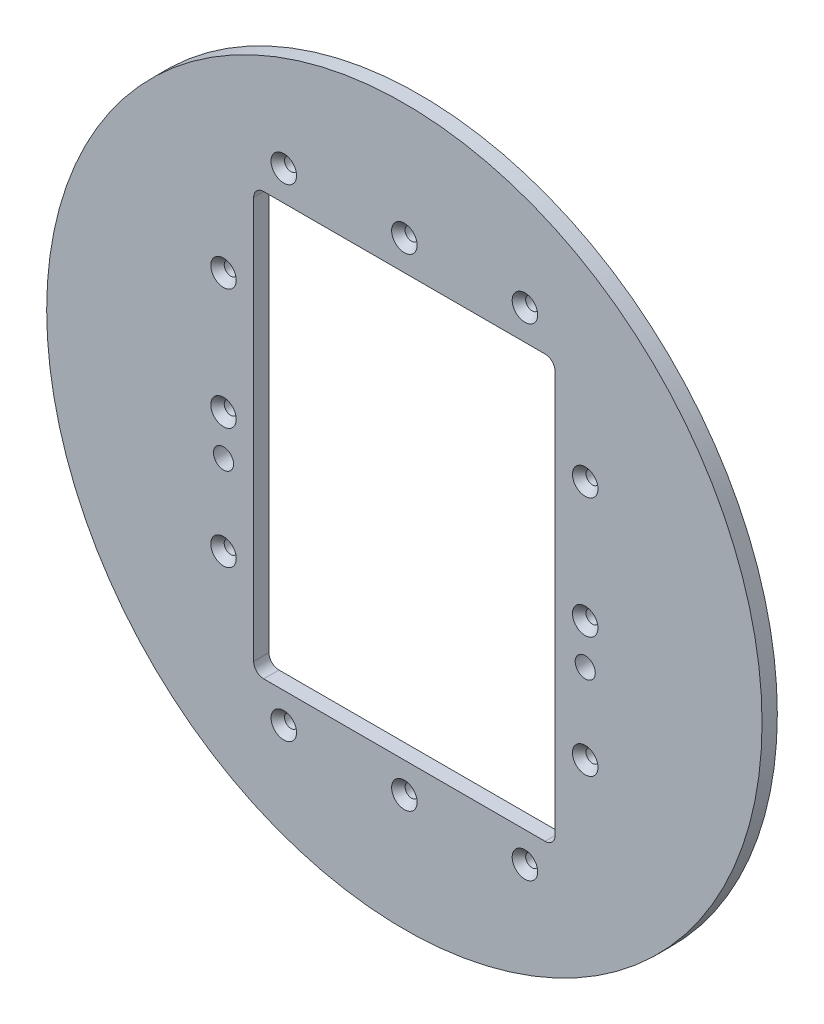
ISO-10303-21;
HEADER;
FILE_DESCRIPTION(('STEP AP214'),'2;1');
FILE_NAME('part.step','',(''),(''),'','','');
FILE_SCHEMA(('AUTOMOTIVE_DESIGN { 1 0 10303 214 1 1 1 1 }'));
ENDSEC;
DATA;
#1=APPLICATION_CONTEXT('core data for automotive mechanical design processes');
#2=APPLICATION_PROTOCOL_DEFINITION('international standard','automotive_design',2000,#1);
#3=PRODUCT_CONTEXT('',#1,'mechanical');
#4=PRODUCT('Part','Part','',(#3));
#5=PRODUCT_RELATED_PRODUCT_CATEGORY('part','',(#4));
#6=PRODUCT_DEFINITION_FORMATION('','',#4);
#7=PRODUCT_DEFINITION_CONTEXT('part definition',#1,'design');
#8=PRODUCT_DEFINITION('design','',#6,#7);
#9=PRODUCT_DEFINITION_SHAPE('','',#8);
#10=(LENGTH_UNIT() NAMED_UNIT(*) SI_UNIT(.MILLI.,.METRE.));
#11=(NAMED_UNIT(*) PLANE_ANGLE_UNIT() SI_UNIT($,.RADIAN.));
#12=(NAMED_UNIT(*) SI_UNIT($,.STERADIAN.) SOLID_ANGLE_UNIT());
#13=UNCERTAINTY_MEASURE_WITH_UNIT(LENGTH_MEASURE(1.E-05),#10,'distance_accuracy_value','');
#14=(GEOMETRIC_REPRESENTATION_CONTEXT(3) GLOBAL_UNCERTAINTY_ASSIGNED_CONTEXT((#13)) GLOBAL_UNIT_ASSIGNED_CONTEXT((#10,
#11,#12)) REPRESENTATION_CONTEXT('',''));
#15=CARTESIAN_POINT('',(0.,0.,0.));
#16=DIRECTION('',(0.,0.,1.));
#17=DIRECTION('',(1.,0.,0.));
#18=AXIS2_PLACEMENT_3D('',#15,#16,#17);
#19=CARTESIAN_POINT('',(0.,0.,-9.652));
#20=DIRECTION('',(0.,0.,1.));
#21=DIRECTION('',(1.,0.,0.));
#22=AXIS2_PLACEMENT_3D('',#19,#20,#21);
#23=CYLINDRICAL_SURFACE('',#22,226.06);
#24=CARTESIAN_POINT('',(0.,0.,-9.652));
#25=DIRECTION('',(0.,0.,1.));
#26=DIRECTION('',(1.,0.,0.));
#27=AXIS2_PLACEMENT_3D('',#24,#25,#26);
#28=CIRCLE('',#27,226.06);
#29=CARTESIAN_POINT('',(226.06,0.,-9.652));
#30=VERTEX_POINT('',#29);
#31=EDGE_CURVE('E152',#30,#30,#28,.T.);
#32=ORIENTED_EDGE('',*,*,#31,.T.);
#33=EDGE_LOOP('',(#32));
#34=FACE_BOUND('',#33,.T.);
#35=CARTESIAN_POINT('',(0.,0.,0.));
#36=DIRECTION('',(0.,0.,1.));
#37=DIRECTION('',(1.,0.,0.));
#38=AXIS2_PLACEMENT_3D('',#35,#36,#37);
#39=CIRCLE('',#38,226.06);
#40=CARTESIAN_POINT('',(226.06,0.,0.));
#41=VERTEX_POINT('',#40);
#42=EDGE_CURVE('E156',#41,#41,#39,.T.);
#43=ORIENTED_EDGE('',*,*,#42,.F.);
#44=EDGE_LOOP('',(#43));
#45=FACE_BOUND('',#44,.T.);
#46=ADVANCED_FACE('F41',(#34,#45),#23,.T.);
#47=CARTESIAN_POINT('',(0.,0.,-9.652));
#48=DIRECTION('',(0.,0.,1.));
#49=DIRECTION('',(1.,0.,0.));
#50=AXIS2_PLACEMENT_3D('',#47,#48,#49);
#51=PLANE('',#50);
#52=CARTESIAN_POINT('',(-114.3,-25.4,-9.652));
#53=DIRECTION('',(0.,0.,1.));
#54=DIRECTION('',(1.,0.,0.));
#55=AXIS2_PLACEMENT_3D('',#52,#53,#54);
#56=CIRCLE('',#55,6.34999999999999);
#57=CARTESIAN_POINT('',(-107.95,-25.4,-9.652));
#58=VERTEX_POINT('',#57);
#59=EDGE_CURVE('E365',#58,#58,#56,.T.);
#60=ORIENTED_EDGE('',*,*,#59,.T.);
#61=EDGE_LOOP('',(#60));
#62=FACE_BOUND('',#61,.T.);
#63=CARTESIAN_POINT('',(114.3,-25.4,-9.652));
#64=DIRECTION('',(0.,0.,1.));
#65=DIRECTION('',(1.,0.,0.));
#66=AXIS2_PLACEMENT_3D('',#63,#64,#65);
#67=CIRCLE('',#66,6.34999999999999);
#68=CARTESIAN_POINT('',(120.65,-25.4,-9.652));
#69=VERTEX_POINT('',#68);
#70=EDGE_CURVE('E357',#69,#69,#67,.T.);
#71=ORIENTED_EDGE('',*,*,#70,.T.);
#72=EDGE_LOOP('',(#71));
#73=FACE_BOUND('',#72,.T.);
#74=CARTESIAN_POINT('',(0.,152.4,-9.652));
#75=DIRECTION('',(0.,0.,1.));
#76=DIRECTION('',(1.,0.,0.));
#77=AXIS2_PLACEMENT_3D('',#74,#75,#76);
#78=CIRCLE('',#77,4.1021);
#79=CARTESIAN_POINT('',(4.1021,152.4,-9.652));
#80=VERTEX_POINT('',#79);
#81=EDGE_CURVE('E345',#80,#80,#78,.T.);
#82=ORIENTED_EDGE('',*,*,#81,.T.);
#83=EDGE_LOOP('',(#82));
#84=FACE_BOUND('',#83,.T.);
#85=CARTESIAN_POINT('',(0.,-152.4,-9.652));
#86=DIRECTION('',(0.,0.,1.));
#87=DIRECTION('',(1.,0.,0.));
#88=AXIS2_PLACEMENT_3D('',#85,#86,#87);
#89=CIRCLE('',#88,4.1021);
#90=CARTESIAN_POINT('',(4.1021,-152.4,-9.652));
#91=VERTEX_POINT('',#90);
#92=EDGE_CURVE('E333',#91,#91,#89,.T.);
#93=ORIENTED_EDGE('',*,*,#92,.T.);
#94=EDGE_LOOP('',(#93));
#95=FACE_BOUND('',#94,.T.);
#96=CARTESIAN_POINT('',(114.3,76.2,-9.652));
#97=DIRECTION('',(0.,0.,1.));
#98=DIRECTION('',(1.,0.,0.));
#99=AXIS2_PLACEMENT_3D('',#96,#97,#98);
#100=CIRCLE('',#99,4.1021);
#101=CARTESIAN_POINT('',(118.4021,76.2,-9.652));
#102=VERTEX_POINT('',#101);
#103=EDGE_CURVE('E321',#102,#102,#100,.T.);
#104=ORIENTED_EDGE('',*,*,#103,.T.);
#105=EDGE_LOOP('',(#104));
#106=FACE_BOUND('',#105,.T.);
#107=CARTESIAN_POINT('',(114.3,-76.2,-9.652));
#108=DIRECTION('',(0.,0.,1.));
#109=DIRECTION('',(1.,0.,0.));
#110=AXIS2_PLACEMENT_3D('',#107,#108,#109);
#111=CIRCLE('',#110,4.1021);
#112=CARTESIAN_POINT('',(118.4021,-76.2,-9.652));
#113=VERTEX_POINT('',#112);
#114=EDGE_CURVE('E309',#113,#113,#111,.T.);
#115=ORIENTED_EDGE('',*,*,#114,.T.);
#116=EDGE_LOOP('',(#115));
#117=FACE_BOUND('',#116,.T.);
#118=CARTESIAN_POINT('',(114.3,0.,-9.652));
#119=DIRECTION('',(0.,0.,1.));
#120=DIRECTION('',(1.,0.,0.));
#121=AXIS2_PLACEMENT_3D('',#118,#119,#120);
#122=CIRCLE('',#121,4.1021);
#123=CARTESIAN_POINT('',(118.4021,0.,-9.652));
#124=VERTEX_POINT('',#123);
#125=EDGE_CURVE('E297',#124,#124,#122,.T.);
#126=ORIENTED_EDGE('',*,*,#125,.T.);
#127=EDGE_LOOP('',(#126));
#128=FACE_BOUND('',#127,.T.);
#129=CARTESIAN_POINT('',(-114.3,76.2,-9.652));
#130=DIRECTION('',(0.,0.,1.));
#131=DIRECTION('',(1.,0.,0.));
#132=AXIS2_PLACEMENT_3D('',#129,#130,#131);
#133=CIRCLE('',#132,4.1021);
#134=CARTESIAN_POINT('',(-110.1979,76.2,-9.652));
#135=VERTEX_POINT('',#134);
#136=EDGE_CURVE('E285',#135,#135,#133,.T.);
#137=ORIENTED_EDGE('',*,*,#136,.T.);
#138=EDGE_LOOP('',(#137));
#139=FACE_BOUND('',#138,.T.);
#140=CARTESIAN_POINT('',(-114.3,0.,-9.652));
#141=DIRECTION('',(0.,0.,1.));
#142=DIRECTION('',(1.,0.,0.));
#143=AXIS2_PLACEMENT_3D('',#140,#141,#142);
#144=CIRCLE('',#143,4.1021);
#145=CARTESIAN_POINT('',(-110.1979,0.,-9.652));
#146=VERTEX_POINT('',#145);
#147=EDGE_CURVE('E273',#146,#146,#144,.T.);
#148=ORIENTED_EDGE('',*,*,#147,.T.);
#149=EDGE_LOOP('',(#148));
#150=FACE_BOUND('',#149,.T.);
#151=CARTESIAN_POINT('',(-114.3,-76.2,-9.652));
#152=DIRECTION('',(0.,0.,1.));
#153=DIRECTION('',(1.,0.,0.));
#154=AXIS2_PLACEMENT_3D('',#151,#152,#153);
#155=CIRCLE('',#154,4.1021);
#156=CARTESIAN_POINT('',(-110.1979,-76.2,-9.652));
#157=VERTEX_POINT('',#156);
#158=EDGE_CURVE('E261',#157,#157,#155,.T.);
#159=ORIENTED_EDGE('',*,*,#158,.T.);
#160=EDGE_LOOP('',(#159));
#161=FACE_BOUND('',#160,.T.);
#162=CARTESIAN_POINT('',(-76.2,152.4,-9.652));
#163=DIRECTION('',(0.,0.,1.));
#164=DIRECTION('',(1.,0.,0.));
#165=AXIS2_PLACEMENT_3D('',#162,#163,#164);
#166=CIRCLE('',#165,4.1021);
#167=CARTESIAN_POINT('',(-72.0979,152.4,-9.652));
#168=VERTEX_POINT('',#167);
#169=EDGE_CURVE('E249',#168,#168,#166,.T.);
#170=ORIENTED_EDGE('',*,*,#169,.T.);
#171=EDGE_LOOP('',(#170));
#172=FACE_BOUND('',#171,.T.);
#173=CARTESIAN_POINT('',(76.2,152.4,-9.652));
#174=DIRECTION('',(0.,0.,1.));
#175=DIRECTION('',(1.,0.,0.));
#176=AXIS2_PLACEMENT_3D('',#173,#174,#175);
#177=CIRCLE('',#176,4.1021);
#178=CARTESIAN_POINT('',(80.3021,152.4,-9.652));
#179=VERTEX_POINT('',#178);
#180=EDGE_CURVE('E237',#179,#179,#177,.T.);
#181=ORIENTED_EDGE('',*,*,#180,.T.);
#182=EDGE_LOOP('',(#181));
#183=FACE_BOUND('',#182,.T.);
#184=CARTESIAN_POINT('',(-76.2,-152.4,-9.652));
#185=DIRECTION('',(0.,0.,1.));
#186=DIRECTION('',(1.,0.,0.));
#187=AXIS2_PLACEMENT_3D('',#184,#185,#186);
#188=CIRCLE('',#187,4.1021);
#189=CARTESIAN_POINT('',(-72.0979,-152.4,-9.652));
#190=VERTEX_POINT('',#189);
#191=EDGE_CURVE('E225',#190,#190,#188,.T.);
#192=ORIENTED_EDGE('',*,*,#191,.T.);
#193=EDGE_LOOP('',(#192));
#194=FACE_BOUND('',#193,.T.);
#195=CARTESIAN_POINT('',(76.2000000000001,-152.4,-9.652));
#196=DIRECTION('',(0.,0.,1.));
#197=DIRECTION('',(1.,0.,0.));
#198=AXIS2_PLACEMENT_3D('',#195,#196,#197);
#199=CIRCLE('',#198,4.1021);
#200=CARTESIAN_POINT('',(80.3021000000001,-152.4,-9.652));
#201=VERTEX_POINT('',#200);
#202=EDGE_CURVE('E145',#201,#201,#199,.T.);
#203=ORIENTED_EDGE('',*,*,#202,.T.);
#204=EDGE_LOOP('',(#203));
#205=FACE_BOUND('',#204,.T.);
#206=DIRECTION('',(0.,-1.,0.));
#207=VECTOR('',#206,1.);
#208=CARTESIAN_POINT('',(-95.25,133.35,-9.652));
#209=LINE('',#208,#207);
#210=CARTESIAN_POINT('',(-95.25,127.,-9.652));
#211=VERTEX_POINT('',#210);
#212=CARTESIAN_POINT('',(-95.25,-127.,-9.652));
#213=VERTEX_POINT('',#212);
#214=EDGE_CURVE('E205',#211,#213,#209,.T.);
#215=ORIENTED_EDGE('',*,*,#214,.T.);
#216=CARTESIAN_POINT('',(-88.9,-127.,-9.652));
#217=DIRECTION('',(0.,0.,1.));
#218=DIRECTION('',(1.,0.,0.));
#219=AXIS2_PLACEMENT_3D('',#216,#217,#218);
#220=CIRCLE('',#219,6.35);
#221=CARTESIAN_POINT('',(-88.9,-133.35,-9.652));
#222=VERTEX_POINT('',#221);
#223=EDGE_CURVE('E11',#213,#222,#220,.T.);
#224=ORIENTED_EDGE('',*,*,#223,.T.);
#225=DIRECTION('',(1.,0.,0.));
#226=VECTOR('',#225,1.);
#227=CARTESIAN_POINT('',(95.25,-133.35,-9.652));
#228=LINE('',#227,#226);
#229=CARTESIAN_POINT('',(88.9,-133.35,-9.652));
#230=VERTEX_POINT('',#229);
#231=EDGE_CURVE('E160',#222,#230,#228,.T.);
#232=ORIENTED_EDGE('',*,*,#231,.T.);
#233=CARTESIAN_POINT('',(88.9,-127.,-9.652));
#234=DIRECTION('',(0.,0.,1.));
#235=DIRECTION('',(1.,0.,0.));
#236=AXIS2_PLACEMENT_3D('',#233,#234,#235);
#237=CIRCLE('',#236,6.35);
#238=CARTESIAN_POINT('',(95.25,-127.,-9.652));
#239=VERTEX_POINT('',#238);
#240=EDGE_CURVE('E191',#230,#239,#237,.T.);
#241=ORIENTED_EDGE('',*,*,#240,.T.);
#242=DIRECTION('',(0.,1.,0.));
#243=VECTOR('',#242,1.);
#244=CARTESIAN_POINT('',(95.25,133.35,-9.652));
#245=LINE('',#244,#243);
#246=CARTESIAN_POINT('',(95.25,127.,-9.652));
#247=VERTEX_POINT('',#246);
#248=EDGE_CURVE('E151',#239,#247,#245,.T.);
#249=ORIENTED_EDGE('',*,*,#248,.T.);
#250=CARTESIAN_POINT('',(88.9,127.,-9.652));
#251=DIRECTION('',(0.,0.,1.));
#252=DIRECTION('',(1.,0.,0.));
#253=AXIS2_PLACEMENT_3D('',#250,#251,#252);
#254=CIRCLE('',#253,6.35);
#255=CARTESIAN_POINT('',(88.9,133.35,-9.652));
#256=VERTEX_POINT('',#255);
#257=EDGE_CURVE('E118',#247,#256,#254,.T.);
#258=ORIENTED_EDGE('',*,*,#257,.T.);
#259=DIRECTION('',(-1.,0.,0.));
#260=VECTOR('',#259,1.);
#261=CARTESIAN_POINT('',(95.25,133.35,-9.652));
#262=LINE('',#261,#260);
#263=CARTESIAN_POINT('',(-88.9,133.35,-9.652));
#264=VERTEX_POINT('',#263);
#265=EDGE_CURVE('E127',#256,#264,#262,.T.);
#266=ORIENTED_EDGE('',*,*,#265,.T.);
#267=CARTESIAN_POINT('',(-88.9,127.,-9.652));
#268=DIRECTION('',(0.,0.,1.));
#269=DIRECTION('',(1.,0.,0.));
#270=AXIS2_PLACEMENT_3D('',#267,#268,#269);
#271=CIRCLE('',#270,6.35);
#272=EDGE_CURVE('E185',#264,#211,#271,.T.);
#273=ORIENTED_EDGE('',*,*,#272,.T.);
#274=EDGE_LOOP('',(#215,#224,#232,#241,#249,#258,#266,#273));
#275=FACE_BOUND('',#274,.T.);
#276=ORIENTED_EDGE('',*,*,#31,.F.);
#277=EDGE_LOOP('',(#276));
#278=FACE_BOUND('',#277,.T.);
#279=ADVANCED_FACE('F379',(#62,#73,#84,#95,#106,#117,#128,#139,#150,#161,#172,#183,#194,#205,
#275,#278),#51,.F.);
#280=CARTESIAN_POINT('',(0.,0.,0.));
#281=DIRECTION('',(0.,0.,1.));
#282=DIRECTION('',(1.,0.,0.));
#283=AXIS2_PLACEMENT_3D('',#280,#281,#282);
#284=PLANE('',#283);
#285=CARTESIAN_POINT('',(-114.3,-25.4,0.));
#286=DIRECTION('',(0.,0.,1.));
#287=DIRECTION('',(1.,0.,0.));
#288=AXIS2_PLACEMENT_3D('',#285,#286,#287);
#289=CIRCLE('',#288,6.34999999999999);
#290=CARTESIAN_POINT('',(-107.95,-25.4,0.));
#291=VERTEX_POINT('',#290);
#292=EDGE_CURVE('E369',#291,#291,#289,.T.);
#293=ORIENTED_EDGE('',*,*,#292,.F.);
#294=EDGE_LOOP('',(#293));
#295=FACE_BOUND('',#294,.T.);
#296=CARTESIAN_POINT('',(114.3,-25.4,0.));
#297=DIRECTION('',(0.,0.,1.));
#298=DIRECTION('',(1.,0.,0.));
#299=AXIS2_PLACEMENT_3D('',#296,#297,#298);
#300=CIRCLE('',#299,6.34999999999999);
#301=CARTESIAN_POINT('',(120.65,-25.4,0.));
#302=VERTEX_POINT('',#301);
#303=EDGE_CURVE('E361',#302,#302,#300,.T.);
#304=ORIENTED_EDGE('',*,*,#303,.F.);
#305=EDGE_LOOP('',(#304));
#306=FACE_BOUND('',#305,.T.);
#307=CARTESIAN_POINT('',(0.,152.4,0.));
#308=DIRECTION('',(0.,0.,1.));
#309=DIRECTION('',(1.,0.,0.));
#310=AXIS2_PLACEMENT_3D('',#307,#308,#309);
#311=CIRCLE('',#310,8.064495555);
#312=CARTESIAN_POINT('',(8.064495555,152.4,0.));
#313=VERTEX_POINT('',#312);
#314=EDGE_CURVE('E353',#313,#313,#311,.T.);
#315=ORIENTED_EDGE('',*,*,#314,.F.);
#316=EDGE_LOOP('',(#315));
#317=FACE_BOUND('',#316,.T.);
#318=CARTESIAN_POINT('',(0.,-152.4,0.));
#319=DIRECTION('',(0.,0.,1.));
#320=DIRECTION('',(1.,0.,0.));
#321=AXIS2_PLACEMENT_3D('',#318,#319,#320);
#322=CIRCLE('',#321,8.064495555);
#323=CARTESIAN_POINT('',(8.064495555,-152.4,0.));
#324=VERTEX_POINT('',#323);
#325=EDGE_CURVE('E341',#324,#324,#322,.T.);
#326=ORIENTED_EDGE('',*,*,#325,.F.);
#327=EDGE_LOOP('',(#326));
#328=FACE_BOUND('',#327,.T.);
#329=CARTESIAN_POINT('',(114.3,76.2,0.));
#330=DIRECTION('',(0.,0.,1.));
#331=DIRECTION('',(1.,0.,0.));
#332=AXIS2_PLACEMENT_3D('',#329,#330,#331);
#333=CIRCLE('',#332,8.064495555);
#334=CARTESIAN_POINT('',(122.364495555,76.2,0.));
#335=VERTEX_POINT('',#334);
#336=EDGE_CURVE('E329',#335,#335,#333,.T.);
#337=ORIENTED_EDGE('',*,*,#336,.F.);
#338=EDGE_LOOP('',(#337));
#339=FACE_BOUND('',#338,.T.);
#340=CARTESIAN_POINT('',(114.3,-76.2,0.));
#341=DIRECTION('',(0.,0.,1.));
#342=DIRECTION('',(1.,0.,0.));
#343=AXIS2_PLACEMENT_3D('',#340,#341,#342);
#344=CIRCLE('',#343,8.064495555);
#345=CARTESIAN_POINT('',(122.364495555,-76.2,0.));
#346=VERTEX_POINT('',#345);
#347=EDGE_CURVE('E317',#346,#346,#344,.T.);
#348=ORIENTED_EDGE('',*,*,#347,.F.);
#349=EDGE_LOOP('',(#348));
#350=FACE_BOUND('',#349,.T.);
#351=CARTESIAN_POINT('',(114.3,0.,0.));
#352=DIRECTION('',(0.,0.,1.));
#353=DIRECTION('',(1.,0.,0.));
#354=AXIS2_PLACEMENT_3D('',#351,#352,#353);
#355=CIRCLE('',#354,8.064495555);
#356=CARTESIAN_POINT('',(122.364495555,0.,0.));
#357=VERTEX_POINT('',#356);
#358=EDGE_CURVE('E305',#357,#357,#355,.T.);
#359=ORIENTED_EDGE('',*,*,#358,.F.);
#360=EDGE_LOOP('',(#359));
#361=FACE_BOUND('',#360,.T.);
#362=CARTESIAN_POINT('',(-114.3,76.2,0.));
#363=DIRECTION('',(0.,0.,1.));
#364=DIRECTION('',(1.,0.,0.));
#365=AXIS2_PLACEMENT_3D('',#362,#363,#364);
#366=CIRCLE('',#365,8.064495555);
#367=CARTESIAN_POINT('',(-106.235504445,76.2,0.));
#368=VERTEX_POINT('',#367);
#369=EDGE_CURVE('E293',#368,#368,#366,.T.);
#370=ORIENTED_EDGE('',*,*,#369,.F.);
#371=EDGE_LOOP('',(#370));
#372=FACE_BOUND('',#371,.T.);
#373=CARTESIAN_POINT('',(-114.3,0.,0.));
#374=DIRECTION('',(0.,0.,1.));
#375=DIRECTION('',(1.,0.,0.));
#376=AXIS2_PLACEMENT_3D('',#373,#374,#375);
#377=CIRCLE('',#376,8.064495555);
#378=CARTESIAN_POINT('',(-106.235504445,0.,0.));
#379=VERTEX_POINT('',#378);
#380=EDGE_CURVE('E281',#379,#379,#377,.T.);
#381=ORIENTED_EDGE('',*,*,#380,.F.);
#382=EDGE_LOOP('',(#381));
#383=FACE_BOUND('',#382,.T.);
#384=CARTESIAN_POINT('',(-114.3,-76.2,0.));
#385=DIRECTION('',(0.,0.,1.));
#386=DIRECTION('',(1.,0.,0.));
#387=AXIS2_PLACEMENT_3D('',#384,#385,#386);
#388=CIRCLE('',#387,8.064495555);
#389=CARTESIAN_POINT('',(-106.235504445,-76.2,0.));
#390=VERTEX_POINT('',#389);
#391=EDGE_CURVE('E269',#390,#390,#388,.T.);
#392=ORIENTED_EDGE('',*,*,#391,.F.);
#393=EDGE_LOOP('',(#392));
#394=FACE_BOUND('',#393,.T.);
#395=CARTESIAN_POINT('',(-76.2,152.4,0.));
#396=DIRECTION('',(0.,0.,1.));
#397=DIRECTION('',(1.,0.,0.));
#398=AXIS2_PLACEMENT_3D('',#395,#396,#397);
#399=CIRCLE('',#398,8.064495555);
#400=CARTESIAN_POINT('',(-68.135504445,152.4,0.));
#401=VERTEX_POINT('',#400);
#402=EDGE_CURVE('E257',#401,#401,#399,.T.);
#403=ORIENTED_EDGE('',*,*,#402,.F.);
#404=EDGE_LOOP('',(#403));
#405=FACE_BOUND('',#404,.T.);
#406=CARTESIAN_POINT('',(76.2,152.4,0.));
#407=DIRECTION('',(0.,0.,1.));
#408=DIRECTION('',(1.,0.,0.));
#409=AXIS2_PLACEMENT_3D('',#406,#407,#408);
#410=CIRCLE('',#409,8.064495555);
#411=CARTESIAN_POINT('',(84.264495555,152.4,0.));
#412=VERTEX_POINT('',#411);
#413=EDGE_CURVE('E245',#412,#412,#410,.T.);
#414=ORIENTED_EDGE('',*,*,#413,.F.);
#415=EDGE_LOOP('',(#414));
#416=FACE_BOUND('',#415,.T.);
#417=CARTESIAN_POINT('',(-76.2,-152.4,0.));
#418=DIRECTION('',(0.,0.,1.));
#419=DIRECTION('',(1.,0.,0.));
#420=AXIS2_PLACEMENT_3D('',#417,#418,#419);
#421=CIRCLE('',#420,8.064495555);
#422=CARTESIAN_POINT('',(-68.135504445,-152.4,0.));
#423=VERTEX_POINT('',#422);
#424=EDGE_CURVE('E233',#423,#423,#421,.T.);
#425=ORIENTED_EDGE('',*,*,#424,.F.);
#426=EDGE_LOOP('',(#425));
#427=FACE_BOUND('',#426,.T.);
#428=CARTESIAN_POINT('',(76.2000000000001,-152.4,0.));
#429=DIRECTION('',(0.,0.,1.));
#430=DIRECTION('',(1.,0.,0.));
#431=AXIS2_PLACEMENT_3D('',#428,#429,#430);
#432=CIRCLE('',#431,8.064495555);
#433=CARTESIAN_POINT('',(84.2644955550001,-152.4,0.));
#434=VERTEX_POINT('',#433);
#435=EDGE_CURVE('E221',#434,#434,#432,.T.);
#436=ORIENTED_EDGE('',*,*,#435,.F.);
#437=EDGE_LOOP('',(#436));
#438=FACE_BOUND('',#437,.T.);
#439=DIRECTION('',(0.,1.,0.));
#440=VECTOR('',#439,1.);
#441=CARTESIAN_POINT('',(95.25,133.35,0.));
#442=LINE('',#441,#440);
#443=CARTESIAN_POINT('',(95.25,-127.,0.));
#444=VERTEX_POINT('',#443);
#445=CARTESIAN_POINT('',(95.25,127.,0.));
#446=VERTEX_POINT('',#445);
#447=EDGE_CURVE('E138',#444,#446,#442,.T.);
#448=ORIENTED_EDGE('',*,*,#447,.F.);
#449=CARTESIAN_POINT('',(88.9,-127.,0.));
#450=DIRECTION('',(0.,0.,1.));
#451=DIRECTION('',(1.,0.,0.));
#452=AXIS2_PLACEMENT_3D('',#449,#450,#451);
#453=CIRCLE('',#452,6.35);
#454=CARTESIAN_POINT('',(88.9,-133.35,0.));
#455=VERTEX_POINT('',#454);
#456=EDGE_CURVE('E188',#444,#455,#453,.F.);
#457=ORIENTED_EDGE('',*,*,#456,.T.);
#458=DIRECTION('',(1.,0.,0.));
#459=VECTOR('',#458,1.);
#460=CARTESIAN_POINT('',(95.25,-133.35,0.));
#461=LINE('',#460,#459);
#462=CARTESIAN_POINT('',(-88.9,-133.35,0.));
#463=VERTEX_POINT('',#462);
#464=EDGE_CURVE('E143',#463,#455,#461,.T.);
#465=ORIENTED_EDGE('',*,*,#464,.F.);
#466=CARTESIAN_POINT('',(-88.9,-127.,0.));
#467=DIRECTION('',(0.,0.,1.));
#468=DIRECTION('',(1.,0.,0.));
#469=AXIS2_PLACEMENT_3D('',#466,#467,#468);
#470=CIRCLE('',#469,6.35);
#471=CARTESIAN_POINT('',(-95.25,-127.,0.));
#472=VERTEX_POINT('',#471);
#473=EDGE_CURVE('E50',#463,#472,#470,.F.);
#474=ORIENTED_EDGE('',*,*,#473,.T.);
#475=DIRECTION('',(0.,-1.,0.));
#476=VECTOR('',#475,1.);
#477=CARTESIAN_POINT('',(-95.25,133.35,0.));
#478=LINE('',#477,#476);
#479=CARTESIAN_POINT('',(-95.25,127.,0.));
#480=VERTEX_POINT('',#479);
#481=EDGE_CURVE('E137',#480,#472,#478,.T.);
#482=ORIENTED_EDGE('',*,*,#481,.F.);
#483=CARTESIAN_POINT('',(-88.9,127.,0.));
#484=DIRECTION('',(0.,0.,1.));
#485=DIRECTION('',(1.,0.,0.));
#486=AXIS2_PLACEMENT_3D('',#483,#484,#485);
#487=CIRCLE('',#486,6.35);
#488=CARTESIAN_POINT('',(-88.9,133.35,0.));
#489=VERTEX_POINT('',#488);
#490=EDGE_CURVE('E135',#480,#489,#487,.F.);
#491=ORIENTED_EDGE('',*,*,#490,.T.);
#492=DIRECTION('',(-1.,0.,0.));
#493=VECTOR('',#492,1.);
#494=CARTESIAN_POINT('',(95.25,133.35,0.));
#495=LINE('',#494,#493);
#496=CARTESIAN_POINT('',(88.9,133.35,0.));
#497=VERTEX_POINT('',#496);
#498=EDGE_CURVE('E124',#497,#489,#495,.T.);
#499=ORIENTED_EDGE('',*,*,#498,.F.);
#500=CARTESIAN_POINT('',(88.9,127.,0.));
#501=DIRECTION('',(0.,0.,1.));
#502=DIRECTION('',(1.,0.,0.));
#503=AXIS2_PLACEMENT_3D('',#500,#501,#502);
#504=CIRCLE('',#503,6.35);
#505=EDGE_CURVE('E107',#497,#446,#504,.F.);
#506=ORIENTED_EDGE('',*,*,#505,.T.);
#507=EDGE_LOOP('',(#448,#457,#465,#474,#482,#491,#499,#506));
#508=FACE_BOUND('',#507,.T.);
#509=ORIENTED_EDGE('',*,*,#42,.T.);
#510=EDGE_LOOP('',(#509));
#511=FACE_BOUND('',#510,.T.);
#512=ADVANCED_FACE('F132',(#295,#306,#317,#328,#339,#350,#361,#372,#383,#394,#405,#416,#427,
#438,#508,#511),#284,.T.);
#513=CARTESIAN_POINT('',(95.25,133.35,-9.652));
#514=DIRECTION('',(1.,0.,0.));
#515=DIRECTION('',(0.,1.,0.));
#516=AXIS2_PLACEMENT_3D('',#513,#514,#515);
#517=PLANE('',#516);
#518=ORIENTED_EDGE('',*,*,#447,.T.);
#519=DIRECTION('',(0.,0.,1.));
#520=VECTOR('',#519,1.);
#521=CARTESIAN_POINT('',(95.25,127.,-9.652));
#522=LINE('',#521,#520);
#523=EDGE_CURVE('E112',#446,#247,#522,.F.);
#524=ORIENTED_EDGE('',*,*,#523,.T.);
#525=ORIENTED_EDGE('',*,*,#248,.F.);
#526=DIRECTION('',(0.,0.,1.));
#527=VECTOR('',#526,1.);
#528=CARTESIAN_POINT('',(95.25,-127.,0.));
#529=LINE('',#528,#527);
#530=EDGE_CURVE('E129',#239,#444,#529,.T.);
#531=ORIENTED_EDGE('',*,*,#530,.T.);
#532=EDGE_LOOP('',(#518,#524,#525,#531));
#533=FACE_BOUND('',#532,.T.);
#534=ADVANCED_FACE('F378',(#533),#517,.F.);
#535=CARTESIAN_POINT('',(95.25,-133.35,-9.652));
#536=DIRECTION('',(0.,-1.,0.));
#537=DIRECTION('',(1.,0.,0.));
#538=AXIS2_PLACEMENT_3D('',#535,#536,#537);
#539=PLANE('',#538);
#540=ORIENTED_EDGE('',*,*,#464,.T.);
#541=DIRECTION('',(0.,0.,1.));
#542=VECTOR('',#541,1.);
#543=CARTESIAN_POINT('',(88.9,-133.35,-9.652));
#544=LINE('',#543,#542);
#545=EDGE_CURVE('E57',#455,#230,#544,.F.);
#546=ORIENTED_EDGE('',*,*,#545,.T.);
#547=ORIENTED_EDGE('',*,*,#231,.F.);
#548=DIRECTION('',(0.,0.,1.));
#549=VECTOR('',#548,1.);
#550=CARTESIAN_POINT('',(-88.9,-133.35,0.));
#551=LINE('',#550,#549);
#552=EDGE_CURVE('E175',#222,#463,#551,.T.);
#553=ORIENTED_EDGE('',*,*,#552,.T.);
#554=EDGE_LOOP('',(#540,#546,#547,#553));
#555=FACE_BOUND('',#554,.T.);
#556=ADVANCED_FACE('F202',(#555),#539,.F.);
#557=CARTESIAN_POINT('',(-95.25,133.35,-9.652));
#558=DIRECTION('',(-1.,0.,0.));
#559=DIRECTION('',(0.,-1.,0.));
#560=AXIS2_PLACEMENT_3D('',#557,#558,#559);
#561=PLANE('',#560);
#562=ORIENTED_EDGE('',*,*,#214,.F.);
#563=DIRECTION('',(0.,0.,1.));
#564=VECTOR('',#563,1.);
#565=CARTESIAN_POINT('',(-95.25,127.,0.));
#566=LINE('',#565,#564);
#567=EDGE_CURVE('E171',#211,#480,#566,.T.);
#568=ORIENTED_EDGE('',*,*,#567,.T.);
#569=ORIENTED_EDGE('',*,*,#481,.T.);
#570=DIRECTION('',(0.,0.,1.));
#571=VECTOR('',#570,1.);
#572=CARTESIAN_POINT('',(-95.25,-127.,-9.652));
#573=LINE('',#572,#571);
#574=EDGE_CURVE('E168',#472,#213,#573,.F.);
#575=ORIENTED_EDGE('',*,*,#574,.T.);
#576=EDGE_LOOP('',(#562,#568,#569,#575));
#577=FACE_BOUND('',#576,.T.);
#578=ADVANCED_FACE('F200',(#577),#561,.F.);
#579=CARTESIAN_POINT('',(95.25,133.35,-9.652));
#580=DIRECTION('',(0.,1.,0.));
#581=DIRECTION('',(-1.,0.,0.));
#582=AXIS2_PLACEMENT_3D('',#579,#580,#581);
#583=PLANE('',#582);
#584=ORIENTED_EDGE('',*,*,#265,.F.);
#585=DIRECTION('',(0.,0.,1.));
#586=VECTOR('',#585,1.);
#587=CARTESIAN_POINT('',(88.9,133.35,0.));
#588=LINE('',#587,#586);
#589=EDGE_CURVE('E111',#256,#497,#588,.T.);
#590=ORIENTED_EDGE('',*,*,#589,.T.);
#591=ORIENTED_EDGE('',*,*,#498,.T.);
#592=DIRECTION('',(0.,0.,1.));
#593=VECTOR('',#592,1.);
#594=CARTESIAN_POINT('',(-88.9,133.35,-9.652));
#595=LINE('',#594,#593);
#596=EDGE_CURVE('E130',#489,#264,#595,.F.);
#597=ORIENTED_EDGE('',*,*,#596,.T.);
#598=EDGE_LOOP('',(#584,#590,#591,#597));
#599=FACE_BOUND('',#598,.T.);
#600=ADVANCED_FACE('F123',(#599),#583,.F.);
#601=CARTESIAN_POINT('',(76.2000000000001,-152.4,0.));
#602=DIRECTION('',(0.,0.,1.));
#603=DIRECTION('',(1.,0.,0.));
#604=AXIS2_PLACEMENT_3D('',#601,#602,#603);
#605=CYLINDRICAL_SURFACE('',#604,4.1021);
#606=ORIENTED_EDGE('',*,*,#202,.F.);
#607=EDGE_LOOP('',(#606));
#608=FACE_BOUND('',#607,.T.);
#609=CARTESIAN_POINT('',(76.2000000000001,-152.4,-4.55821466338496));
#610=DIRECTION('',(0.,0.,1.));
#611=DIRECTION('',(1.,0.,0.));
#612=AXIS2_PLACEMENT_3D('',#609,#610,#611);
#613=CIRCLE('',#612,4.1021);
#614=CARTESIAN_POINT('',(80.3021000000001,-152.4,-4.55821466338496));
#615=VERTEX_POINT('',#614);
#616=EDGE_CURVE('E217',#615,#615,#613,.T.);
#617=ORIENTED_EDGE('',*,*,#616,.T.);
#618=EDGE_LOOP('',(#617));
#619=FACE_BOUND('',#618,.T.);
#620=ADVANCED_FACE('F410',(#608,#619),#605,.F.);
#621=CARTESIAN_POINT('',(76.2000000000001,-152.4,0.));
#622=DIRECTION('',(0.,0.,1.));
#623=DIRECTION('',(1.,0.,0.));
#624=AXIS2_PLACEMENT_3D('',#621,#622,#623);
#625=CONICAL_SURFACE('',#624,8.064495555,0.715584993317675);
#626=ORIENTED_EDGE('',*,*,#616,.F.);
#627=EDGE_LOOP('',(#626));
#628=FACE_BOUND('',#627,.T.);
#629=ORIENTED_EDGE('',*,*,#435,.T.);
#630=EDGE_LOOP('',(#629));
#631=FACE_BOUND('',#630,.T.);
#632=ADVANCED_FACE('F407',(#628,#631),#625,.F.);
#633=CARTESIAN_POINT('',(-76.2,-152.4,0.));
#634=DIRECTION('',(0.,0.,1.));
#635=DIRECTION('',(1.,0.,0.));
#636=AXIS2_PLACEMENT_3D('',#633,#634,#635);
#637=CYLINDRICAL_SURFACE('',#636,4.1021);
#638=ORIENTED_EDGE('',*,*,#191,.F.);
#639=EDGE_LOOP('',(#638));
#640=FACE_BOUND('',#639,.T.);
#641=CARTESIAN_POINT('',(-76.2,-152.4,-4.55821466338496));
#642=DIRECTION('',(0.,0.,1.));
#643=DIRECTION('',(1.,0.,0.));
#644=AXIS2_PLACEMENT_3D('',#641,#642,#643);
#645=CIRCLE('',#644,4.1021);
#646=CARTESIAN_POINT('',(-72.0979,-152.4,-4.55821466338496));
#647=VERTEX_POINT('',#646);
#648=EDGE_CURVE('E229',#647,#647,#645,.T.);
#649=ORIENTED_EDGE('',*,*,#648,.T.);
#650=EDGE_LOOP('',(#649));
#651=FACE_BOUND('',#650,.T.);
#652=ADVANCED_FACE('F409',(#640,#651),#637,.F.);
#653=CARTESIAN_POINT('',(-76.2,-152.4,0.));
#654=DIRECTION('',(0.,0.,1.));
#655=DIRECTION('',(1.,0.,0.));
#656=AXIS2_PLACEMENT_3D('',#653,#654,#655);
#657=CONICAL_SURFACE('',#656,8.064495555,0.715584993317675);
#658=ORIENTED_EDGE('',*,*,#648,.F.);
#659=EDGE_LOOP('',(#658));
#660=FACE_BOUND('',#659,.T.);
#661=ORIENTED_EDGE('',*,*,#424,.T.);
#662=EDGE_LOOP('',(#661));
#663=FACE_BOUND('',#662,.T.);
#664=ADVANCED_FACE('F417',(#660,#663),#657,.F.);
#665=CARTESIAN_POINT('',(76.2,152.4,0.));
#666=DIRECTION('',(0.,0.,1.));
#667=DIRECTION('',(1.,0.,0.));
#668=AXIS2_PLACEMENT_3D('',#665,#666,#667);
#669=CYLINDRICAL_SURFACE('',#668,4.1021);
#670=ORIENTED_EDGE('',*,*,#180,.F.);
#671=EDGE_LOOP('',(#670));
#672=FACE_BOUND('',#671,.T.);
#673=CARTESIAN_POINT('',(76.2,152.4,-4.55821466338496));
#674=DIRECTION('',(0.,0.,1.));
#675=DIRECTION('',(1.,0.,0.));
#676=AXIS2_PLACEMENT_3D('',#673,#674,#675);
#677=CIRCLE('',#676,4.1021);
#678=CARTESIAN_POINT('',(80.3021,152.4,-4.55821466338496));
#679=VERTEX_POINT('',#678);
#680=EDGE_CURVE('E241',#679,#679,#677,.T.);
#681=ORIENTED_EDGE('',*,*,#680,.T.);
#682=EDGE_LOOP('',(#681));
#683=FACE_BOUND('',#682,.T.);
#684=ADVANCED_FACE('F493',(#672,#683),#669,.F.);
#685=CARTESIAN_POINT('',(76.2,152.4,0.));
#686=DIRECTION('',(0.,0.,1.));
#687=DIRECTION('',(1.,0.,0.));
#688=AXIS2_PLACEMENT_3D('',#685,#686,#687);
#689=CONICAL_SURFACE('',#688,8.064495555,0.715584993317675);
#690=ORIENTED_EDGE('',*,*,#680,.F.);
#691=EDGE_LOOP('',(#690));
#692=FACE_BOUND('',#691,.T.);
#693=ORIENTED_EDGE('',*,*,#413,.T.);
#694=EDGE_LOOP('',(#693));
#695=FACE_BOUND('',#694,.T.);
#696=ADVANCED_FACE('F503',(#692,#695),#689,.F.);
#697=CARTESIAN_POINT('',(-76.2,152.4,0.));
#698=DIRECTION('',(0.,0.,1.));
#699=DIRECTION('',(1.,0.,0.));
#700=AXIS2_PLACEMENT_3D('',#697,#698,#699);
#701=CYLINDRICAL_SURFACE('',#700,4.1021);
#702=ORIENTED_EDGE('',*,*,#169,.F.);
#703=EDGE_LOOP('',(#702));
#704=FACE_BOUND('',#703,.T.);
#705=CARTESIAN_POINT('',(-76.2,152.4,-4.55821466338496));
#706=DIRECTION('',(0.,0.,1.));
#707=DIRECTION('',(1.,0.,0.));
#708=AXIS2_PLACEMENT_3D('',#705,#706,#707);
#709=CIRCLE('',#708,4.1021);
#710=CARTESIAN_POINT('',(-72.0979,152.4,-4.55821466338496));
#711=VERTEX_POINT('',#710);
#712=EDGE_CURVE('E253',#711,#711,#709,.T.);
#713=ORIENTED_EDGE('',*,*,#712,.T.);
#714=EDGE_LOOP('',(#713));
#715=FACE_BOUND('',#714,.T.);
#716=ADVANCED_FACE('F513',(#704,#715),#701,.F.);
#717=CARTESIAN_POINT('',(-76.2,152.4,0.));
#718=DIRECTION('',(0.,0.,1.));
#719=DIRECTION('',(1.,0.,0.));
#720=AXIS2_PLACEMENT_3D('',#717,#718,#719);
#721=CONICAL_SURFACE('',#720,8.064495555,0.715584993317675);
#722=ORIENTED_EDGE('',*,*,#712,.F.);
#723=EDGE_LOOP('',(#722));
#724=FACE_BOUND('',#723,.T.);
#725=ORIENTED_EDGE('',*,*,#402,.T.);
#726=EDGE_LOOP('',(#725));
#727=FACE_BOUND('',#726,.T.);
#728=ADVANCED_FACE('F523',(#724,#727),#721,.F.);
#729=CARTESIAN_POINT('',(-114.3,-76.2,0.));
#730=DIRECTION('',(0.,0.,1.));
#731=DIRECTION('',(1.,0.,0.));
#732=AXIS2_PLACEMENT_3D('',#729,#730,#731);
#733=CYLINDRICAL_SURFACE('',#732,4.1021);
#734=ORIENTED_EDGE('',*,*,#158,.F.);
#735=EDGE_LOOP('',(#734));
#736=FACE_BOUND('',#735,.T.);
#737=CARTESIAN_POINT('',(-114.3,-76.2,-4.55821466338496));
#738=DIRECTION('',(0.,0.,1.));
#739=DIRECTION('',(1.,0.,0.));
#740=AXIS2_PLACEMENT_3D('',#737,#738,#739);
#741=CIRCLE('',#740,4.1021);
#742=CARTESIAN_POINT('',(-110.1979,-76.2,-4.55821466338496));
#743=VERTEX_POINT('',#742);
#744=EDGE_CURVE('E265',#743,#743,#741,.T.);
#745=ORIENTED_EDGE('',*,*,#744,.T.);
#746=EDGE_LOOP('',(#745));
#747=FACE_BOUND('',#746,.T.);
#748=ADVANCED_FACE('F533',(#736,#747),#733,.F.);
#749=CARTESIAN_POINT('',(-114.3,-76.2,0.));
#750=DIRECTION('',(0.,0.,1.));
#751=DIRECTION('',(1.,0.,0.));
#752=AXIS2_PLACEMENT_3D('',#749,#750,#751);
#753=CONICAL_SURFACE('',#752,8.064495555,0.715584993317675);
#754=ORIENTED_EDGE('',*,*,#744,.F.);
#755=EDGE_LOOP('',(#754));
#756=FACE_BOUND('',#755,.T.);
#757=ORIENTED_EDGE('',*,*,#391,.T.);
#758=EDGE_LOOP('',(#757));
#759=FACE_BOUND('',#758,.T.);
#760=ADVANCED_FACE('F543',(#756,#759),#753,.F.);
#761=CARTESIAN_POINT('',(-114.3,0.,0.));
#762=DIRECTION('',(0.,0.,1.));
#763=DIRECTION('',(1.,0.,0.));
#764=AXIS2_PLACEMENT_3D('',#761,#762,#763);
#765=CYLINDRICAL_SURFACE('',#764,4.1021);
#766=ORIENTED_EDGE('',*,*,#147,.F.);
#767=EDGE_LOOP('',(#766));
#768=FACE_BOUND('',#767,.T.);
#769=CARTESIAN_POINT('',(-114.3,0.,-4.55821466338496));
#770=DIRECTION('',(0.,0.,1.));
#771=DIRECTION('',(1.,0.,0.));
#772=AXIS2_PLACEMENT_3D('',#769,#770,#771);
#773=CIRCLE('',#772,4.1021);
#774=CARTESIAN_POINT('',(-110.1979,0.,-4.55821466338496));
#775=VERTEX_POINT('',#774);
#776=EDGE_CURVE('E277',#775,#775,#773,.T.);
#777=ORIENTED_EDGE('',*,*,#776,.T.);
#778=EDGE_LOOP('',(#777));
#779=FACE_BOUND('',#778,.T.);
#780=ADVANCED_FACE('F553',(#768,#779),#765,.F.);
#781=CARTESIAN_POINT('',(-114.3,0.,0.));
#782=DIRECTION('',(0.,0.,1.));
#783=DIRECTION('',(1.,0.,0.));
#784=AXIS2_PLACEMENT_3D('',#781,#782,#783);
#785=CONICAL_SURFACE('',#784,8.064495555,0.715584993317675);
#786=ORIENTED_EDGE('',*,*,#776,.F.);
#787=EDGE_LOOP('',(#786));
#788=FACE_BOUND('',#787,.T.);
#789=ORIENTED_EDGE('',*,*,#380,.T.);
#790=EDGE_LOOP('',(#789));
#791=FACE_BOUND('',#790,.T.);
#792=ADVANCED_FACE('F563',(#788,#791),#785,.F.);
#793=CARTESIAN_POINT('',(-114.3,76.2,0.));
#794=DIRECTION('',(0.,0.,1.));
#795=DIRECTION('',(1.,0.,0.));
#796=AXIS2_PLACEMENT_3D('',#793,#794,#795);
#797=CYLINDRICAL_SURFACE('',#796,4.1021);
#798=ORIENTED_EDGE('',*,*,#136,.F.);
#799=EDGE_LOOP('',(#798));
#800=FACE_BOUND('',#799,.T.);
#801=CARTESIAN_POINT('',(-114.3,76.2,-4.55821466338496));
#802=DIRECTION('',(0.,0.,1.));
#803=DIRECTION('',(1.,0.,0.));
#804=AXIS2_PLACEMENT_3D('',#801,#802,#803);
#805=CIRCLE('',#804,4.1021);
#806=CARTESIAN_POINT('',(-110.1979,76.2,-4.55821466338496));
#807=VERTEX_POINT('',#806);
#808=EDGE_CURVE('E289',#807,#807,#805,.T.);
#809=ORIENTED_EDGE('',*,*,#808,.T.);
#810=EDGE_LOOP('',(#809));
#811=FACE_BOUND('',#810,.T.);
#812=ADVANCED_FACE('F573',(#800,#811),#797,.F.);
#813=CARTESIAN_POINT('',(-114.3,76.2,0.));
#814=DIRECTION('',(0.,0.,1.));
#815=DIRECTION('',(1.,0.,0.));
#816=AXIS2_PLACEMENT_3D('',#813,#814,#815);
#817=CONICAL_SURFACE('',#816,8.064495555,0.715584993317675);
#818=ORIENTED_EDGE('',*,*,#808,.F.);
#819=EDGE_LOOP('',(#818));
#820=FACE_BOUND('',#819,.T.);
#821=ORIENTED_EDGE('',*,*,#369,.T.);
#822=EDGE_LOOP('',(#821));
#823=FACE_BOUND('',#822,.T.);
#824=ADVANCED_FACE('F583',(#820,#823),#817,.F.);
#825=CARTESIAN_POINT('',(114.3,0.,0.));
#826=DIRECTION('',(0.,0.,1.));
#827=DIRECTION('',(1.,0.,0.));
#828=AXIS2_PLACEMENT_3D('',#825,#826,#827);
#829=CYLINDRICAL_SURFACE('',#828,4.1021);
#830=ORIENTED_EDGE('',*,*,#125,.F.);
#831=EDGE_LOOP('',(#830));
#832=FACE_BOUND('',#831,.T.);
#833=CARTESIAN_POINT('',(114.3,0.,-4.55821466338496));
#834=DIRECTION('',(0.,0.,1.));
#835=DIRECTION('',(1.,0.,0.));
#836=AXIS2_PLACEMENT_3D('',#833,#834,#835);
#837=CIRCLE('',#836,4.1021);
#838=CARTESIAN_POINT('',(118.4021,0.,-4.55821466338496));
#839=VERTEX_POINT('',#838);
#840=EDGE_CURVE('E301',#839,#839,#837,.T.);
#841=ORIENTED_EDGE('',*,*,#840,.T.);
#842=EDGE_LOOP('',(#841));
#843=FACE_BOUND('',#842,.T.);
#844=ADVANCED_FACE('F593',(#832,#843),#829,.F.);
#845=CARTESIAN_POINT('',(114.3,0.,0.));
#846=DIRECTION('',(0.,0.,1.));
#847=DIRECTION('',(1.,0.,0.));
#848=AXIS2_PLACEMENT_3D('',#845,#846,#847);
#849=CONICAL_SURFACE('',#848,8.064495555,0.715584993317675);
#850=ORIENTED_EDGE('',*,*,#840,.F.);
#851=EDGE_LOOP('',(#850));
#852=FACE_BOUND('',#851,.T.);
#853=ORIENTED_EDGE('',*,*,#358,.T.);
#854=EDGE_LOOP('',(#853));
#855=FACE_BOUND('',#854,.T.);
#856=ADVANCED_FACE('F603',(#852,#855),#849,.F.);
#857=CARTESIAN_POINT('',(114.3,-76.2,0.));
#858=DIRECTION('',(0.,0.,1.));
#859=DIRECTION('',(1.,0.,0.));
#860=AXIS2_PLACEMENT_3D('',#857,#858,#859);
#861=CYLINDRICAL_SURFACE('',#860,4.1021);
#862=ORIENTED_EDGE('',*,*,#114,.F.);
#863=EDGE_LOOP('',(#862));
#864=FACE_BOUND('',#863,.T.);
#865=CARTESIAN_POINT('',(114.3,-76.2,-4.55821466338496));
#866=DIRECTION('',(0.,0.,1.));
#867=DIRECTION('',(1.,0.,0.));
#868=AXIS2_PLACEMENT_3D('',#865,#866,#867);
#869=CIRCLE('',#868,4.1021);
#870=CARTESIAN_POINT('',(118.4021,-76.2,-4.55821466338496));
#871=VERTEX_POINT('',#870);
#872=EDGE_CURVE('E313',#871,#871,#869,.T.);
#873=ORIENTED_EDGE('',*,*,#872,.T.);
#874=EDGE_LOOP('',(#873));
#875=FACE_BOUND('',#874,.T.);
#876=ADVANCED_FACE('F613',(#864,#875),#861,.F.);
#877=CARTESIAN_POINT('',(114.3,-76.2,0.));
#878=DIRECTION('',(0.,0.,1.));
#879=DIRECTION('',(1.,0.,0.));
#880=AXIS2_PLACEMENT_3D('',#877,#878,#879);
#881=CONICAL_SURFACE('',#880,8.064495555,0.715584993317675);
#882=ORIENTED_EDGE('',*,*,#872,.F.);
#883=EDGE_LOOP('',(#882));
#884=FACE_BOUND('',#883,.T.);
#885=ORIENTED_EDGE('',*,*,#347,.T.);
#886=EDGE_LOOP('',(#885));
#887=FACE_BOUND('',#886,.T.);
#888=ADVANCED_FACE('F623',(#884,#887),#881,.F.);
#889=CARTESIAN_POINT('',(114.3,76.2,0.));
#890=DIRECTION('',(0.,0.,1.));
#891=DIRECTION('',(1.,0.,0.));
#892=AXIS2_PLACEMENT_3D('',#889,#890,#891);
#893=CYLINDRICAL_SURFACE('',#892,4.1021);
#894=ORIENTED_EDGE('',*,*,#103,.F.);
#895=EDGE_LOOP('',(#894));
#896=FACE_BOUND('',#895,.T.);
#897=CARTESIAN_POINT('',(114.3,76.2,-4.55821466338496));
#898=DIRECTION('',(0.,0.,1.));
#899=DIRECTION('',(1.,0.,0.));
#900=AXIS2_PLACEMENT_3D('',#897,#898,#899);
#901=CIRCLE('',#900,4.1021);
#902=CARTESIAN_POINT('',(118.4021,76.2,-4.55821466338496));
#903=VERTEX_POINT('',#902);
#904=EDGE_CURVE('E325',#903,#903,#901,.T.);
#905=ORIENTED_EDGE('',*,*,#904,.T.);
#906=EDGE_LOOP('',(#905));
#907=FACE_BOUND('',#906,.T.);
#908=ADVANCED_FACE('F633',(#896,#907),#893,.F.);
#909=CARTESIAN_POINT('',(114.3,76.2,0.));
#910=DIRECTION('',(0.,0.,1.));
#911=DIRECTION('',(1.,0.,0.));
#912=AXIS2_PLACEMENT_3D('',#909,#910,#911);
#913=CONICAL_SURFACE('',#912,8.064495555,0.715584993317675);
#914=ORIENTED_EDGE('',*,*,#904,.F.);
#915=EDGE_LOOP('',(#914));
#916=FACE_BOUND('',#915,.T.);
#917=ORIENTED_EDGE('',*,*,#336,.T.);
#918=EDGE_LOOP('',(#917));
#919=FACE_BOUND('',#918,.T.);
#920=ADVANCED_FACE('F643',(#916,#919),#913,.F.);
#921=CARTESIAN_POINT('',(0.,-152.4,0.));
#922=DIRECTION('',(0.,0.,1.));
#923=DIRECTION('',(1.,0.,0.));
#924=AXIS2_PLACEMENT_3D('',#921,#922,#923);
#925=CYLINDRICAL_SURFACE('',#924,4.1021);
#926=ORIENTED_EDGE('',*,*,#92,.F.);
#927=EDGE_LOOP('',(#926));
#928=FACE_BOUND('',#927,.T.);
#929=CARTESIAN_POINT('',(0.,-152.4,-4.55821466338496));
#930=DIRECTION('',(0.,0.,1.));
#931=DIRECTION('',(1.,0.,0.));
#932=AXIS2_PLACEMENT_3D('',#929,#930,#931);
#933=CIRCLE('',#932,4.1021);
#934=CARTESIAN_POINT('',(4.1021,-152.4,-4.55821466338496));
#935=VERTEX_POINT('',#934);
#936=EDGE_CURVE('E337',#935,#935,#933,.T.);
#937=ORIENTED_EDGE('',*,*,#936,.T.);
#938=EDGE_LOOP('',(#937));
#939=FACE_BOUND('',#938,.T.);
#940=ADVANCED_FACE('F653',(#928,#939),#925,.F.);
#941=CARTESIAN_POINT('',(0.,-152.4,0.));
#942=DIRECTION('',(0.,0.,1.));
#943=DIRECTION('',(1.,0.,0.));
#944=AXIS2_PLACEMENT_3D('',#941,#942,#943);
#945=CONICAL_SURFACE('',#944,8.064495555,0.715584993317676);
#946=ORIENTED_EDGE('',*,*,#936,.F.);
#947=EDGE_LOOP('',(#946));
#948=FACE_BOUND('',#947,.T.);
#949=ORIENTED_EDGE('',*,*,#325,.T.);
#950=EDGE_LOOP('',(#949));
#951=FACE_BOUND('',#950,.T.);
#952=ADVANCED_FACE('F663',(#948,#951),#945,.F.);
#953=CARTESIAN_POINT('',(0.,152.4,0.));
#954=DIRECTION('',(0.,0.,1.));
#955=DIRECTION('',(1.,0.,0.));
#956=AXIS2_PLACEMENT_3D('',#953,#954,#955);
#957=CYLINDRICAL_SURFACE('',#956,4.1021);
#958=ORIENTED_EDGE('',*,*,#81,.F.);
#959=EDGE_LOOP('',(#958));
#960=FACE_BOUND('',#959,.T.);
#961=CARTESIAN_POINT('',(0.,152.4,-4.55821466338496));
#962=DIRECTION('',(0.,0.,1.));
#963=DIRECTION('',(1.,0.,0.));
#964=AXIS2_PLACEMENT_3D('',#961,#962,#963);
#965=CIRCLE('',#964,4.1021);
#966=CARTESIAN_POINT('',(4.1021,152.4,-4.55821466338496));
#967=VERTEX_POINT('',#966);
#968=EDGE_CURVE('E349',#967,#967,#965,.T.);
#969=ORIENTED_EDGE('',*,*,#968,.T.);
#970=EDGE_LOOP('',(#969));
#971=FACE_BOUND('',#970,.T.);
#972=ADVANCED_FACE('F673',(#960,#971),#957,.F.);
#973=CARTESIAN_POINT('',(0.,152.4,0.));
#974=DIRECTION('',(0.,0.,1.));
#975=DIRECTION('',(1.,0.,0.));
#976=AXIS2_PLACEMENT_3D('',#973,#974,#975);
#977=CONICAL_SURFACE('',#976,8.064495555,0.715584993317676);
#978=ORIENTED_EDGE('',*,*,#968,.F.);
#979=EDGE_LOOP('',(#978));
#980=FACE_BOUND('',#979,.T.);
#981=ORIENTED_EDGE('',*,*,#314,.T.);
#982=EDGE_LOOP('',(#981));
#983=FACE_BOUND('',#982,.T.);
#984=ADVANCED_FACE('F683',(#980,#983),#977,.F.);
#985=CARTESIAN_POINT('',(114.3,-25.4,0.));
#986=DIRECTION('',(0.,0.,1.));
#987=DIRECTION('',(1.,0.,0.));
#988=AXIS2_PLACEMENT_3D('',#985,#986,#987);
#989=CYLINDRICAL_SURFACE('',#988,6.34999999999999);
#990=ORIENTED_EDGE('',*,*,#70,.F.);
#991=EDGE_LOOP('',(#990));
#992=FACE_BOUND('',#991,.T.);
#993=ORIENTED_EDGE('',*,*,#303,.T.);
#994=EDGE_LOOP('',(#993));
#995=FACE_BOUND('',#994,.T.);
#996=ADVANCED_FACE('F693',(#992,#995),#989,.F.);
#997=CARTESIAN_POINT('',(-114.3,-25.4,0.));
#998=DIRECTION('',(0.,0.,1.));
#999=DIRECTION('',(1.,0.,0.));
#1000=AXIS2_PLACEMENT_3D('',#997,#998,#999);
#1001=CYLINDRICAL_SURFACE('',#1000,6.34999999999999);
#1002=ORIENTED_EDGE('',*,*,#59,.F.);
#1003=EDGE_LOOP('',(#1002));
#1004=FACE_BOUND('',#1003,.T.);
#1005=ORIENTED_EDGE('',*,*,#292,.T.);
#1006=EDGE_LOOP('',(#1005));
#1007=FACE_BOUND('',#1006,.T.);
#1008=ADVANCED_FACE('F374',(#1004,#1007),#1001,.F.);
#1009=CARTESIAN_POINT('',(88.9,127.,-9.652));
#1010=DIRECTION('',(0.,0.,-1.));
#1011=DIRECTION('',(-1.,0.,0.));
#1012=AXIS2_PLACEMENT_3D('',#1009,#1010,#1011);
#1013=CYLINDRICAL_SURFACE('',#1012,6.35);
#1014=ORIENTED_EDGE('',*,*,#257,.F.);
#1015=ORIENTED_EDGE('',*,*,#523,.F.);
#1016=ORIENTED_EDGE('',*,*,#505,.F.);
#1017=ORIENTED_EDGE('',*,*,#589,.F.);
#1018=EDGE_LOOP('',(#1014,#1015,#1016,#1017));
#1019=FACE_BOUND('',#1018,.T.);
#1020=ADVANCED_FACE('F110',(#1019),#1013,.F.);
#1021=CARTESIAN_POINT('',(-88.9,127.,-9.652));
#1022=DIRECTION('',(0.,0.,-1.));
#1023=DIRECTION('',(-1.,0.,0.));
#1024=AXIS2_PLACEMENT_3D('',#1021,#1022,#1023);
#1025=CYLINDRICAL_SURFACE('',#1024,6.35);
#1026=ORIENTED_EDGE('',*,*,#272,.F.);
#1027=ORIENTED_EDGE('',*,*,#596,.F.);
#1028=ORIENTED_EDGE('',*,*,#490,.F.);
#1029=ORIENTED_EDGE('',*,*,#567,.F.);
#1030=EDGE_LOOP('',(#1026,#1027,#1028,#1029));
#1031=FACE_BOUND('',#1030,.T.);
#1032=ADVANCED_FACE('F435',(#1031),#1025,.F.);
#1033=CARTESIAN_POINT('',(88.9,-127.,-9.652));
#1034=DIRECTION('',(0.,0.,-1.));
#1035=DIRECTION('',(-1.,0.,0.));
#1036=AXIS2_PLACEMENT_3D('',#1033,#1034,#1035);
#1037=CYLINDRICAL_SURFACE('',#1036,6.35);
#1038=ORIENTED_EDGE('',*,*,#240,.F.);
#1039=ORIENTED_EDGE('',*,*,#545,.F.);
#1040=ORIENTED_EDGE('',*,*,#456,.F.);
#1041=ORIENTED_EDGE('',*,*,#530,.F.);
#1042=EDGE_LOOP('',(#1038,#1039,#1040,#1041));
#1043=FACE_BOUND('',#1042,.T.);
#1044=ADVANCED_FACE('F437',(#1043),#1037,.F.);
#1045=CARTESIAN_POINT('',(-88.9,-127.,-9.652));
#1046=DIRECTION('',(0.,0.,-1.));
#1047=DIRECTION('',(-1.,0.,0.));
#1048=AXIS2_PLACEMENT_3D('',#1045,#1046,#1047);
#1049=CYLINDRICAL_SURFACE('',#1048,6.35);
#1050=ORIENTED_EDGE('',*,*,#223,.F.);
#1051=ORIENTED_EDGE('',*,*,#574,.F.);
#1052=ORIENTED_EDGE('',*,*,#473,.F.);
#1053=ORIENTED_EDGE('',*,*,#552,.F.);
#1054=EDGE_LOOP('',(#1050,#1051,#1052,#1053));
#1055=FACE_BOUND('',#1054,.T.);
#1056=ADVANCED_FACE('F43',(#1055),#1049,.F.);
#1057=CLOSED_SHELL('',(#46,#279,#512,#534,#556,#578,#600,#620,#632,#652,#664,#684,#696,#716,
#728,#748,#760,#780,#792,#812,#824,#844,#856,#876,#888,#908,#920,#940,#952,#972,#984,#996,#1008,
#1020,#1032,#1044,#1056));
#1058=MANIFOLD_SOLID_BREP('B2',#1057);
#1059=ADVANCED_BREP_SHAPE_REPRESENTATION('',(#18,#1058),#14);
#1060=SHAPE_DEFINITION_REPRESENTATION(#9,#1059);
ENDSEC;
END-ISO-10303-21;
